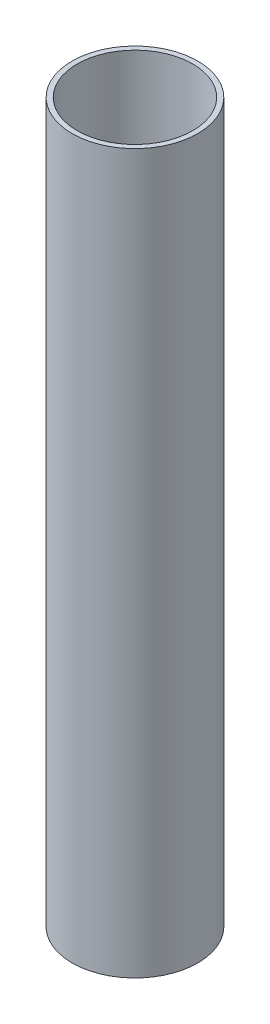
ISO-10303-21;
HEADER;
FILE_DESCRIPTION(('STEP AP214'),'2;1');
FILE_NAME('part.step','',(''),(''),'','','');
FILE_SCHEMA(('AUTOMOTIVE_DESIGN { 1 0 10303 214 1 1 1 1 }'));
ENDSEC;
DATA;
#1=APPLICATION_CONTEXT('core data for automotive mechanical design processes');
#2=APPLICATION_PROTOCOL_DEFINITION('international standard','automotive_design',2000,#1);
#3=PRODUCT_CONTEXT('',#1,'mechanical');
#4=PRODUCT('Part','Part','',(#3));
#5=PRODUCT_RELATED_PRODUCT_CATEGORY('part','',(#4));
#6=PRODUCT_DEFINITION_FORMATION('','',#4);
#7=PRODUCT_DEFINITION_CONTEXT('part definition',#1,'design');
#8=PRODUCT_DEFINITION('design','',#6,#7);
#9=PRODUCT_DEFINITION_SHAPE('','',#8);
#10=(LENGTH_UNIT() NAMED_UNIT(*) SI_UNIT(.MILLI.,.METRE.));
#11=(NAMED_UNIT(*) PLANE_ANGLE_UNIT() SI_UNIT($,.RADIAN.));
#12=(NAMED_UNIT(*) SI_UNIT($,.STERADIAN.) SOLID_ANGLE_UNIT());
#13=UNCERTAINTY_MEASURE_WITH_UNIT(LENGTH_MEASURE(1.E-05),#10,'distance_accuracy_value','');
#14=(GEOMETRIC_REPRESENTATION_CONTEXT(3) GLOBAL_UNCERTAINTY_ASSIGNED_CONTEXT((#13)) GLOBAL_UNIT_ASSIGNED_CONTEXT((#10,
#11,#12)) REPRESENTATION_CONTEXT('',''));
#15=CARTESIAN_POINT('',(0.,0.,0.));
#16=DIRECTION('',(0.,0.,1.));
#17=DIRECTION('',(1.,0.,0.));
#18=AXIS2_PLACEMENT_3D('',#15,#16,#17);
#19=CARTESIAN_POINT('',(0.,63.5,0.));
#20=DIRECTION('',(0.,1.,0.));
#21=DIRECTION('',(0.,0.,1.));
#22=AXIS2_PLACEMENT_3D('',#19,#20,#21);
#23=PLANE('',#22);
#24=CARTESIAN_POINT('',(0.,63.5,0.));
#25=DIRECTION('',(0.,1.,0.));
#26=DIRECTION('',(0.,0.,1.));
#27=AXIS2_PLACEMENT_3D('',#24,#25,#26);
#28=CIRCLE('',#27,11.1125);
#29=CARTESIAN_POINT('',(0.,63.5,11.1125));
#30=VERTEX_POINT('',#29);
#31=EDGE_CURVE('E11',#30,#30,#28,.T.);
#32=ORIENTED_EDGE('',*,*,#31,.T.);
#33=EDGE_LOOP('',(#32));
#34=FACE_BOUND('',#33,.T.);
#35=CARTESIAN_POINT('',(0.,63.5,0.));
#36=DIRECTION('',(0.,1.,0.));
#37=DIRECTION('',(1.,0.,0.));
#38=AXIS2_PLACEMENT_3D('',#35,#36,#37);
#39=CIRCLE('',#38,10.2235);
#40=CARTESIAN_POINT('',(10.2235,63.5,0.));
#41=VERTEX_POINT('',#40);
#42=EDGE_CURVE('E51',#41,#41,#39,.T.);
#43=ORIENTED_EDGE('',*,*,#42,.F.);
#44=EDGE_LOOP('',(#43));
#45=FACE_BOUND('',#44,.T.);
#46=ADVANCED_FACE('F40',(#34,#45),#23,.T.);
#47=CARTESIAN_POINT('',(0.,-63.5,0.));
#48=DIRECTION('',(0.,1.,0.));
#49=DIRECTION('',(0.,0.,1.));
#50=AXIS2_PLACEMENT_3D('',#47,#48,#49);
#51=PLANE('',#50);
#52=CARTESIAN_POINT('',(0.,-63.5,0.));
#53=DIRECTION('',(0.,1.,0.));
#54=DIRECTION('',(0.,0.,1.));
#55=AXIS2_PLACEMENT_3D('',#52,#53,#54);
#56=CIRCLE('',#55,11.1125);
#57=CARTESIAN_POINT('',(0.,-63.5,11.1125));
#58=VERTEX_POINT('',#57);
#59=EDGE_CURVE('E44',#58,#58,#56,.T.);
#60=ORIENTED_EDGE('',*,*,#59,.F.);
#61=EDGE_LOOP('',(#60));
#62=FACE_BOUND('',#61,.T.);
#63=CARTESIAN_POINT('',(0.,-63.5,0.));
#64=DIRECTION('',(0.,1.,0.));
#65=DIRECTION('',(1.,0.,0.));
#66=AXIS2_PLACEMENT_3D('',#63,#64,#65);
#67=CIRCLE('',#66,10.2235);
#68=CARTESIAN_POINT('',(10.2235,-63.5,0.));
#69=VERTEX_POINT('',#68);
#70=EDGE_CURVE('E53',#69,#69,#67,.T.);
#71=ORIENTED_EDGE('',*,*,#70,.T.);
#72=EDGE_LOOP('',(#71));
#73=FACE_BOUND('',#72,.T.);
#74=ADVANCED_FACE('F63',(#62,#73),#51,.F.);
#75=CARTESIAN_POINT('',(0.,63.5,0.));
#76=DIRECTION('',(0.,-1.,0.));
#77=DIRECTION('',(0.,0.,-1.));
#78=AXIS2_PLACEMENT_3D('',#75,#76,#77);
#79=CYLINDRICAL_SURFACE('',#78,11.1125);
#80=ORIENTED_EDGE('',*,*,#31,.F.);
#81=EDGE_LOOP('',(#80));
#82=FACE_BOUND('',#81,.T.);
#83=ORIENTED_EDGE('',*,*,#59,.T.);
#84=EDGE_LOOP('',(#83));
#85=FACE_BOUND('',#84,.T.);
#86=ADVANCED_FACE('F42',(#82,#85),#79,.T.);
#87=CARTESIAN_POINT('',(0.,63.5,0.));
#88=DIRECTION('',(0.,-1.,0.));
#89=DIRECTION('',(0.,0.,-1.));
#90=AXIS2_PLACEMENT_3D('',#87,#88,#89);
#91=CYLINDRICAL_SURFACE('',#90,10.2235);
#92=ORIENTED_EDGE('',*,*,#42,.T.);
#93=EDGE_LOOP('',(#92));
#94=FACE_BOUND('',#93,.T.);
#95=ORIENTED_EDGE('',*,*,#70,.F.);
#96=EDGE_LOOP('',(#95));
#97=FACE_BOUND('',#96,.T.);
#98=ADVANCED_FACE('F59',(#94,#97),#91,.F.);
#99=CLOSED_SHELL('',(#46,#74,#86,#98));
#100=MANIFOLD_SOLID_BREP('B2',#99);
#101=ADVANCED_BREP_SHAPE_REPRESENTATION('',(#18,#100),#14);
#102=SHAPE_DEFINITION_REPRESENTATION(#9,#101);
ENDSEC;
END-ISO-10303-21;
